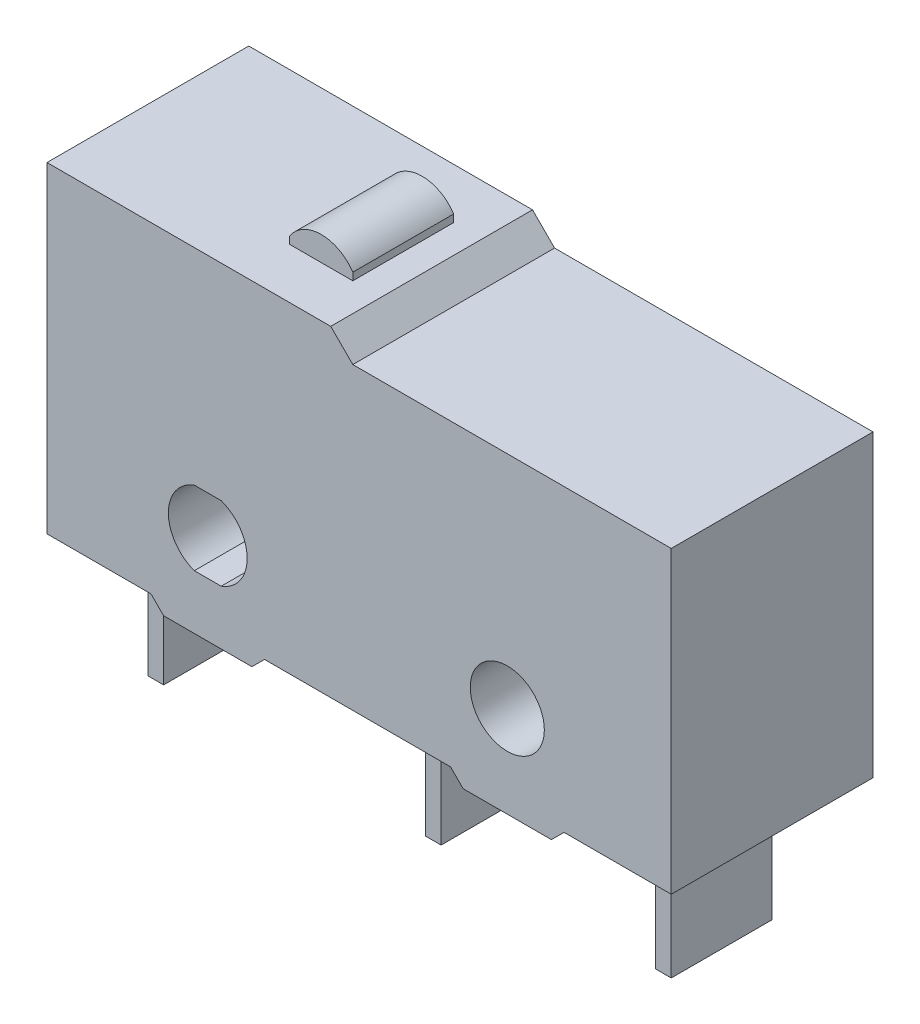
ISO-10303-21;
HEADER;
FILE_DESCRIPTION(('STEP AP214'),'2;1');
FILE_NAME('part.step','',(''),(''),'','','');
FILE_SCHEMA(('AUTOMOTIVE_DESIGN { 1 0 10303 214 1 1 1 1 }'));
ENDSEC;
DATA;
#1=APPLICATION_CONTEXT('core data for automotive mechanical design processes');
#2=APPLICATION_PROTOCOL_DEFINITION('international standard','automotive_design',2000,#1);
#3=PRODUCT_CONTEXT('',#1,'mechanical');
#4=PRODUCT('Part','Part','',(#3));
#5=PRODUCT_RELATED_PRODUCT_CATEGORY('part','',(#4));
#6=PRODUCT_DEFINITION_FORMATION('','',#4);
#7=PRODUCT_DEFINITION_CONTEXT('part definition',#1,'design');
#8=PRODUCT_DEFINITION('design','',#6,#7);
#9=PRODUCT_DEFINITION_SHAPE('','',#8);
#10=(LENGTH_UNIT() NAMED_UNIT(*) SI_UNIT(.MILLI.,.METRE.));
#11=(NAMED_UNIT(*) PLANE_ANGLE_UNIT() SI_UNIT($,.RADIAN.));
#12=(NAMED_UNIT(*) SI_UNIT($,.STERADIAN.) SOLID_ANGLE_UNIT());
#13=UNCERTAINTY_MEASURE_WITH_UNIT(LENGTH_MEASURE(1.E-05),#10,'distance_accuracy_value','');
#14=(GEOMETRIC_REPRESENTATION_CONTEXT(3) GLOBAL_UNCERTAINTY_ASSIGNED_CONTEXT((#13)) GLOBAL_UNIT_ASSIGNED_CONTEXT((#10,
#11,#12)) REPRESENTATION_CONTEXT('',''));
#15=CARTESIAN_POINT('',(0.,0.,0.));
#16=DIRECTION('',(0.,0.,1.));
#17=DIRECTION('',(1.,0.,0.));
#18=AXIS2_PLACEMENT_3D('',#15,#16,#17);
#19=CARTESIAN_POINT('',(-11.3,-2.5,3.2));
#20=DIRECTION('',(0.,1.,0.));
#21=DIRECTION('',(-1.,0.,0.));
#22=AXIS2_PLACEMENT_3D('',#19,#20,#21);
#23=PLANE('',#22);
#24=DIRECTION('',(1.,0.,0.));
#25=VECTOR('',#24,1.);
#26=CARTESIAN_POINT('',(-11.3,-2.5,-3.2));
#27=LINE('',#26,#25);
#28=CARTESIAN_POINT('',(-14.6,-2.5,-3.2));
#29=VERTEX_POINT('',#28);
#30=CARTESIAN_POINT('',(-11.3,-2.5,-3.2));
#31=VERTEX_POINT('',#30);
#32=EDGE_CURVE('E416',#29,#31,#27,.T.);
#33=ORIENTED_EDGE('',*,*,#32,.T.);
#34=DIRECTION('',(0.,0.,-1.));
#35=VECTOR('',#34,1.);
#36=CARTESIAN_POINT('',(-11.3,-2.5,3.2));
#37=LINE('',#36,#35);
#38=CARTESIAN_POINT('',(-11.3,-2.5,3.2));
#39=VERTEX_POINT('',#38);
#40=EDGE_CURVE('E482',#39,#31,#37,.T.);
#41=ORIENTED_EDGE('',*,*,#40,.F.);
#42=DIRECTION('',(1.,0.,0.));
#43=VECTOR('',#42,1.);
#44=CARTESIAN_POINT('',(-11.3,-2.5,3.2));
#45=LINE('',#44,#43);
#46=CARTESIAN_POINT('',(-14.6,-2.5,3.2));
#47=VERTEX_POINT('',#46);
#48=EDGE_CURVE('E445',#47,#39,#45,.T.);
#49=ORIENTED_EDGE('',*,*,#48,.F.);
#50=DIRECTION('',(0.,0.,-1.));
#51=VECTOR('',#50,1.);
#52=CARTESIAN_POINT('',(-14.6,-2.5,3.2));
#53=LINE('',#52,#51);
#54=EDGE_CURVE('E485',#47,#29,#53,.T.);
#55=ORIENTED_EDGE('',*,*,#54,.T.);
#56=EDGE_LOOP('',(#33,#41,#49,#55));
#57=FACE_BOUND('',#56,.T.);
#58=DIRECTION('',(0.,0.,-1.));
#59=VECTOR('',#58,1.);
#60=CARTESIAN_POINT('',(-13.,-2.5,1.6));
#61=LINE('',#60,#59);
#62=CARTESIAN_POINT('',(-13.,-2.5,1.6));
#63=VERTEX_POINT('',#62);
#64=CARTESIAN_POINT('',(-13.,-2.5,-1.6));
#65=VERTEX_POINT('',#64);
#66=EDGE_CURVE('E266',#63,#65,#61,.T.);
#67=ORIENTED_EDGE('',*,*,#66,.F.);
#68=DIRECTION('',(-1.,0.,0.));
#69=VECTOR('',#68,1.);
#70=CARTESIAN_POINT('',(-13.,-2.5,1.6));
#71=LINE('',#70,#69);
#72=CARTESIAN_POINT('',(-12.5,-2.5,1.6));
#73=VERTEX_POINT('',#72);
#74=EDGE_CURVE('E244',#73,#63,#71,.T.);
#75=ORIENTED_EDGE('',*,*,#74,.F.);
#76=DIRECTION('',(0.,0.,1.));
#77=VECTOR('',#76,1.);
#78=CARTESIAN_POINT('',(-12.5,-2.5,1.6));
#79=LINE('',#78,#77);
#80=CARTESIAN_POINT('',(-12.5,-2.5,-1.6));
#81=VERTEX_POINT('',#80);
#82=EDGE_CURVE('E37',#81,#73,#79,.T.);
#83=ORIENTED_EDGE('',*,*,#82,.F.);
#84=DIRECTION('',(1.,0.,0.));
#85=VECTOR('',#84,1.);
#86=CARTESIAN_POINT('',(-13.,-2.5,-1.6));
#87=LINE('',#86,#85);
#88=EDGE_CURVE('E32',#65,#81,#87,.T.);
#89=ORIENTED_EDGE('',*,*,#88,.F.);
#90=EDGE_LOOP('',(#67,#75,#83,#89));
#91=FACE_BOUND('',#90,.T.);
#92=ADVANCED_FACE('F17',(#57,#91),#23,.F.);
#93=CARTESIAN_POINT('',(5.2,-2.5,3.2));
#94=DIRECTION('',(0.,1.,0.));
#95=DIRECTION('',(-1.,0.,0.));
#96=AXIS2_PLACEMENT_3D('',#93,#94,#95);
#97=PLANE('',#96);
#98=DIRECTION('',(1.,0.,0.));
#99=VECTOR('',#98,1.);
#100=CARTESIAN_POINT('',(5.2,-2.5,-3.2));
#101=LINE('',#100,#99);
#102=CARTESIAN_POINT('',(1.8,-2.5,-3.2));
#103=VERTEX_POINT('',#102);
#104=CARTESIAN_POINT('',(5.2,-2.5,-3.2));
#105=VERTEX_POINT('',#104);
#106=EDGE_CURVE('E403',#103,#105,#101,.T.);
#107=ORIENTED_EDGE('',*,*,#106,.T.);
#108=DIRECTION('',(0.,0.,-1.));
#109=VECTOR('',#108,1.);
#110=CARTESIAN_POINT('',(5.2,-2.5,3.2));
#111=LINE('',#110,#109);
#112=CARTESIAN_POINT('',(5.2,-2.5,3.2));
#113=VERTEX_POINT('',#112);
#114=EDGE_CURVE('E25',#113,#105,#111,.T.);
#115=ORIENTED_EDGE('',*,*,#114,.F.);
#116=DIRECTION('',(1.,0.,0.));
#117=VECTOR('',#116,1.);
#118=CARTESIAN_POINT('',(5.2,-2.5,3.2));
#119=LINE('',#118,#117);
#120=CARTESIAN_POINT('',(1.8,-2.5,3.2));
#121=VERTEX_POINT('',#120);
#122=EDGE_CURVE('E432',#121,#113,#119,.T.);
#123=ORIENTED_EDGE('',*,*,#122,.F.);
#124=DIRECTION('',(0.,0.,-1.));
#125=VECTOR('',#124,1.);
#126=CARTESIAN_POINT('',(1.8,-2.5,3.2));
#127=LINE('',#126,#125);
#128=EDGE_CURVE('E461',#121,#103,#127,.T.);
#129=ORIENTED_EDGE('',*,*,#128,.T.);
#130=EDGE_LOOP('',(#107,#115,#123,#129));
#131=FACE_BOUND('',#130,.T.);
#132=DIRECTION('',(0.,0.,-1.));
#133=VECTOR('',#132,1.);
#134=CARTESIAN_POINT('',(3.1,-2.5,1.6));
#135=LINE('',#134,#133);
#136=CARTESIAN_POINT('',(3.1,-2.5,1.6));
#137=VERTEX_POINT('',#136);
#138=CARTESIAN_POINT('',(3.1,-2.5,-1.6));
#139=VERTEX_POINT('',#138);
#140=EDGE_CURVE('E259',#137,#139,#135,.T.);
#141=ORIENTED_EDGE('',*,*,#140,.F.);
#142=DIRECTION('',(-1.,0.,0.));
#143=VECTOR('',#142,1.);
#144=CARTESIAN_POINT('',(3.1,-2.5,1.6));
#145=LINE('',#144,#143);
#146=CARTESIAN_POINT('',(3.6,-2.5,1.6));
#147=VERTEX_POINT('',#146);
#148=EDGE_CURVE('E280',#147,#137,#145,.T.);
#149=ORIENTED_EDGE('',*,*,#148,.F.);
#150=DIRECTION('',(0.,0.,1.));
#151=VECTOR('',#150,1.);
#152=CARTESIAN_POINT('',(3.6,-2.5,1.6));
#153=LINE('',#152,#151);
#154=CARTESIAN_POINT('',(3.6,-2.5,-1.6));
#155=VERTEX_POINT('',#154);
#156=EDGE_CURVE('E277',#155,#147,#153,.T.);
#157=ORIENTED_EDGE('',*,*,#156,.F.);
#158=DIRECTION('',(1.,0.,0.));
#159=VECTOR('',#158,1.);
#160=CARTESIAN_POINT('',(3.1,-2.5,-1.6));
#161=LINE('',#160,#159);
#162=EDGE_CURVE('E262',#139,#155,#161,.T.);
#163=ORIENTED_EDGE('',*,*,#162,.F.);
#164=EDGE_LOOP('',(#141,#149,#157,#163));
#165=FACE_BOUND('',#164,.T.);
#166=ADVANCED_FACE('F19',(#131,#165),#97,.F.);
#167=CARTESIAN_POINT('',(-1.8,-2.5,3.2));
#168=DIRECTION('',(0.,1.,0.));
#169=DIRECTION('',(-1.,0.,0.));
#170=AXIS2_PLACEMENT_3D('',#167,#168,#169);
#171=PLANE('',#170);
#172=DIRECTION('',(1.,0.,0.));
#173=VECTOR('',#172,1.);
#174=CARTESIAN_POINT('',(-1.8,-2.5,-3.2));
#175=LINE('',#174,#173);
#176=CARTESIAN_POINT('',(-7.7,-2.5,-3.2));
#177=VERTEX_POINT('',#176);
#178=CARTESIAN_POINT('',(-1.8,-2.5,-3.2));
#179=VERTEX_POINT('',#178);
#180=EDGE_CURVE('E424',#177,#179,#175,.T.);
#181=ORIENTED_EDGE('',*,*,#180,.T.);
#182=DIRECTION('',(0.,0.,-1.));
#183=VECTOR('',#182,1.);
#184=CARTESIAN_POINT('',(-1.8,-2.5,3.2));
#185=LINE('',#184,#183);
#186=CARTESIAN_POINT('',(-1.8,-2.5,3.2));
#187=VERTEX_POINT('',#186);
#188=EDGE_CURVE('E470',#187,#179,#185,.T.);
#189=ORIENTED_EDGE('',*,*,#188,.F.);
#190=DIRECTION('',(1.,0.,0.));
#191=VECTOR('',#190,1.);
#192=CARTESIAN_POINT('',(-1.8,-2.5,3.2));
#193=LINE('',#192,#191);
#194=CARTESIAN_POINT('',(-7.7,-2.5,3.2));
#195=VERTEX_POINT('',#194);
#196=EDGE_CURVE('E453',#195,#187,#193,.T.);
#197=ORIENTED_EDGE('',*,*,#196,.F.);
#198=DIRECTION('',(0.,0.,-1.));
#199=VECTOR('',#198,1.);
#200=CARTESIAN_POINT('',(-7.7,-2.5,3.2));
#201=LINE('',#200,#199);
#202=EDGE_CURVE('E473',#195,#177,#201,.T.);
#203=ORIENTED_EDGE('',*,*,#202,.T.);
#204=EDGE_LOOP('',(#181,#189,#197,#203));
#205=FACE_BOUND('',#204,.T.);
#206=DIRECTION('',(0.,0.,-1.));
#207=VECTOR('',#206,1.);
#208=CARTESIAN_POINT('',(-4.2,-2.5,1.6));
#209=LINE('',#208,#207);
#210=CARTESIAN_POINT('',(-4.2,-2.5,1.6));
#211=VERTEX_POINT('',#210);
#212=CARTESIAN_POINT('',(-4.2,-2.5,-1.6));
#213=VERTEX_POINT('',#212);
#214=EDGE_CURVE('E304',#211,#213,#209,.T.);
#215=ORIENTED_EDGE('',*,*,#214,.F.);
#216=DIRECTION('',(-1.,0.,0.));
#217=VECTOR('',#216,1.);
#218=CARTESIAN_POINT('',(-4.2,-2.5,1.6));
#219=LINE('',#218,#217);
#220=CARTESIAN_POINT('',(-3.7,-2.5,1.6));
#221=VERTEX_POINT('',#220);
#222=EDGE_CURVE('E313',#221,#211,#219,.T.);
#223=ORIENTED_EDGE('',*,*,#222,.F.);
#224=DIRECTION('',(0.,0.,1.));
#225=VECTOR('',#224,1.);
#226=CARTESIAN_POINT('',(-3.7,-2.5,1.6));
#227=LINE('',#226,#225);
#228=CARTESIAN_POINT('',(-3.7,-2.5,-1.6));
#229=VERTEX_POINT('',#228);
#230=EDGE_CURVE('E310',#229,#221,#227,.T.);
#231=ORIENTED_EDGE('',*,*,#230,.F.);
#232=DIRECTION('',(1.,0.,0.));
#233=VECTOR('',#232,1.);
#234=CARTESIAN_POINT('',(-4.2,-2.5,-1.6));
#235=LINE('',#234,#233);
#236=EDGE_CURVE('E307',#213,#229,#235,.T.);
#237=ORIENTED_EDGE('',*,*,#236,.F.);
#238=EDGE_LOOP('',(#215,#223,#231,#237));
#239=FACE_BOUND('',#238,.T.);
#240=ADVANCED_FACE('F545',(#205,#239),#171,.F.);
#241=CARTESIAN_POINT('',(-6.5,10.7,1.6));
#242=DIRECTION('',(-1.,0.,0.));
#243=DIRECTION('',(0.,-1.,0.));
#244=AXIS2_PLACEMENT_3D('',#241,#242,#243);
#245=PLANE('',#244);
#246=DIRECTION('',(0.,0.,-1.));
#247=VECTOR('',#246,1.);
#248=CARTESIAN_POINT('',(-6.5,7.9361781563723,38.6735015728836));
#249=LINE('',#248,#247);
#250=CARTESIAN_POINT('',(-6.5,7.9361781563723,1.6));
#251=VERTEX_POINT('',#250);
#252=CARTESIAN_POINT('',(-6.5,7.9361781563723,-1.6));
#253=VERTEX_POINT('',#252);
#254=EDGE_CURVE('E338',#251,#253,#249,.T.);
#255=ORIENTED_EDGE('',*,*,#254,.F.);
#256=DIRECTION('',(0.,-1.,0.));
#257=VECTOR('',#256,1.);
#258=CARTESIAN_POINT('',(-6.5,10.7,1.6));
#259=LINE('',#258,#257);
#260=CARTESIAN_POINT('',(-6.5,7.7,1.6));
#261=VERTEX_POINT('',#260);
#262=EDGE_CURVE('E357',#251,#261,#259,.T.);
#263=ORIENTED_EDGE('',*,*,#262,.T.);
#264=DIRECTION('',(0.,0.,-1.));
#265=VECTOR('',#264,1.);
#266=CARTESIAN_POINT('',(-6.5,7.7,1.6));
#267=LINE('',#266,#265);
#268=CARTESIAN_POINT('',(-6.5,7.7,-1.6));
#269=VERTEX_POINT('',#268);
#270=EDGE_CURVE('E345',#261,#269,#267,.T.);
#271=ORIENTED_EDGE('',*,*,#270,.T.);
#272=DIRECTION('',(0.,-1.,0.));
#273=VECTOR('',#272,1.);
#274=CARTESIAN_POINT('',(-6.5,10.7,-1.6));
#275=LINE('',#274,#273);
#276=EDGE_CURVE('E363',#253,#269,#275,.T.);
#277=ORIENTED_EDGE('',*,*,#276,.F.);
#278=EDGE_LOOP('',(#255,#263,#271,#277));
#279=FACE_BOUND('',#278,.T.);
#280=ADVANCED_FACE('F593',(#279),#245,.F.);
#281=CARTESIAN_POINT('',(-6.5,10.7,-1.6));
#282=DIRECTION('',(0.,0.,1.));
#283=DIRECTION('',(1.,0.,0.));
#284=AXIS2_PLACEMENT_3D('',#281,#282,#283);
#285=PLANE('',#284);
#286=CARTESIAN_POINT('',(-7.5,7.27285319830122,-1.6));
#287=DIRECTION('',(0.,0.,1.));
#288=DIRECTION('',(1.,0.,0.));
#289=AXIS2_PLACEMENT_3D('',#286,#287,#288);
#290=CIRCLE('',#289,1.2);
#291=CARTESIAN_POINT('',(-8.5,7.93617815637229,-1.6));
#292=VERTEX_POINT('',#291);
#293=EDGE_CURVE('E341',#253,#292,#290,.T.);
#294=ORIENTED_EDGE('',*,*,#293,.F.);
#295=ORIENTED_EDGE('',*,*,#276,.T.);
#296=DIRECTION('',(-1.,0.,0.));
#297=VECTOR('',#296,1.);
#298=CARTESIAN_POINT('',(-6.5,7.7,-1.6));
#299=LINE('',#298,#297);
#300=CARTESIAN_POINT('',(-8.5,7.7,-1.6));
#301=VERTEX_POINT('',#300);
#302=EDGE_CURVE('E348',#269,#301,#299,.T.);
#303=ORIENTED_EDGE('',*,*,#302,.T.);
#304=DIRECTION('',(0.,-1.,0.));
#305=VECTOR('',#304,1.);
#306=CARTESIAN_POINT('',(-8.5,10.7,-1.6));
#307=LINE('',#306,#305);
#308=EDGE_CURVE('E361',#292,#301,#307,.T.);
#309=ORIENTED_EDGE('',*,*,#308,.F.);
#310=EDGE_LOOP('',(#294,#295,#303,#309));
#311=FACE_BOUND('',#310,.T.);
#312=ADVANCED_FACE('F592',(#311),#285,.F.);
#313=CARTESIAN_POINT('',(-8.5,10.7,1.6));
#314=DIRECTION('',(1.,0.,0.));
#315=DIRECTION('',(0.,1.,0.));
#316=AXIS2_PLACEMENT_3D('',#313,#314,#315);
#317=PLANE('',#316);
#318=DIRECTION('',(0.,0.,-1.));
#319=VECTOR('',#318,1.);
#320=CARTESIAN_POINT('',(-8.5,7.9361781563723,38.6735015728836));
#321=LINE('',#320,#319);
#322=CARTESIAN_POINT('',(-8.5,7.93617815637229,1.6));
#323=VERTEX_POINT('',#322);
#324=EDGE_CURVE('E337',#323,#292,#321,.T.);
#325=ORIENTED_EDGE('',*,*,#324,.T.);
#326=ORIENTED_EDGE('',*,*,#308,.T.);
#327=DIRECTION('',(0.,0.,1.));
#328=VECTOR('',#327,1.);
#329=CARTESIAN_POINT('',(-8.5,7.7,1.6));
#330=LINE('',#329,#328);
#331=CARTESIAN_POINT('',(-8.5,7.7,1.6));
#332=VERTEX_POINT('',#331);
#333=EDGE_CURVE('E351',#301,#332,#330,.T.);
#334=ORIENTED_EDGE('',*,*,#333,.T.);
#335=DIRECTION('',(0.,-1.,0.));
#336=VECTOR('',#335,1.);
#337=CARTESIAN_POINT('',(-8.5,10.7,1.6));
#338=LINE('',#337,#336);
#339=EDGE_CURVE('E359',#323,#332,#338,.T.);
#340=ORIENTED_EDGE('',*,*,#339,.F.);
#341=EDGE_LOOP('',(#325,#326,#334,#340));
#342=FACE_BOUND('',#341,.T.);
#343=ADVANCED_FACE('F587',(#342),#317,.F.);
#344=CARTESIAN_POINT('',(-6.5,10.7,1.6));
#345=DIRECTION('',(0.,0.,-1.));
#346=DIRECTION('',(-1.,0.,0.));
#347=AXIS2_PLACEMENT_3D('',#344,#345,#346);
#348=PLANE('',#347);
#349=CARTESIAN_POINT('',(-7.5,7.27285319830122,1.6));
#350=DIRECTION('',(0.,0.,-1.));
#351=DIRECTION('',(-1.,0.,0.));
#352=AXIS2_PLACEMENT_3D('',#349,#350,#351);
#353=CIRCLE('',#352,1.2);
#354=EDGE_CURVE('E11',#323,#251,#353,.T.);
#355=ORIENTED_EDGE('',*,*,#354,.F.);
#356=ORIENTED_EDGE('',*,*,#339,.T.);
#357=DIRECTION('',(1.,0.,0.));
#358=VECTOR('',#357,1.);
#359=CARTESIAN_POINT('',(-6.5,7.7,1.6));
#360=LINE('',#359,#358);
#361=EDGE_CURVE('E354',#332,#261,#360,.T.);
#362=ORIENTED_EDGE('',*,*,#361,.T.);
#363=ORIENTED_EDGE('',*,*,#262,.F.);
#364=EDGE_LOOP('',(#355,#356,#362,#363));
#365=FACE_BOUND('',#364,.T.);
#366=ADVANCED_FACE('F574',(#365),#348,.F.);
#367=CARTESIAN_POINT('',(-14.6,7.7,3.2));
#368=DIRECTION('',(0.,-1.,0.));
#369=DIRECTION('',(1.,0.,0.));
#370=AXIS2_PLACEMENT_3D('',#367,#368,#369);
#371=PLANE('',#370);
#372=DIRECTION('',(-1.,0.,0.));
#373=VECTOR('',#372,1.);
#374=CARTESIAN_POINT('',(-14.6,7.7,-3.2));
#375=LINE('',#374,#373);
#376=CARTESIAN_POINT('',(-5.6,7.7,-3.2));
#377=VERTEX_POINT('',#376);
#378=CARTESIAN_POINT('',(-14.6,7.7,-3.2));
#379=VERTEX_POINT('',#378);
#380=EDGE_CURVE('E412',#377,#379,#375,.T.);
#381=ORIENTED_EDGE('',*,*,#380,.T.);
#382=DIRECTION('',(0.,0.,-1.));
#383=VECTOR('',#382,1.);
#384=CARTESIAN_POINT('',(-14.6,7.7,3.2));
#385=LINE('',#384,#383);
#386=CARTESIAN_POINT('',(-14.6,7.7,3.2));
#387=VERTEX_POINT('',#386);
#388=EDGE_CURVE('E488',#387,#379,#385,.T.);
#389=ORIENTED_EDGE('',*,*,#388,.F.);
#390=DIRECTION('',(-1.,0.,0.));
#391=VECTOR('',#390,1.);
#392=CARTESIAN_POINT('',(-14.6,7.7,3.2));
#393=LINE('',#392,#391);
#394=CARTESIAN_POINT('',(-5.6,7.7,3.2));
#395=VERTEX_POINT('',#394);
#396=EDGE_CURVE('E441',#395,#387,#393,.T.);
#397=ORIENTED_EDGE('',*,*,#396,.F.);
#398=DIRECTION('',(0.,0.,-1.));
#399=VECTOR('',#398,1.);
#400=CARTESIAN_POINT('',(-5.6,7.7,3.2));
#401=LINE('',#400,#399);
#402=EDGE_CURVE('E491',#395,#377,#401,.T.);
#403=ORIENTED_EDGE('',*,*,#402,.T.);
#404=EDGE_LOOP('',(#381,#389,#397,#403));
#405=FACE_BOUND('',#404,.T.);
#406=ORIENTED_EDGE('',*,*,#270,.F.);
#407=ORIENTED_EDGE('',*,*,#361,.F.);
#408=ORIENTED_EDGE('',*,*,#333,.F.);
#409=ORIENTED_EDGE('',*,*,#302,.F.);
#410=EDGE_LOOP('',(#406,#407,#408,#409));
#411=FACE_BOUND('',#410,.T.);
#412=ADVANCED_FACE('F571',(#405,#411),#371,.F.);
#413=CARTESIAN_POINT('',(5.2,7.,3.2));
#414=DIRECTION('',(-1.,0.,0.));
#415=DIRECTION('',(0.,-1.,0.));
#416=AXIS2_PLACEMENT_3D('',#413,#414,#415);
#417=PLANE('',#416);
#418=DIRECTION('',(0.,1.,0.));
#419=VECTOR('',#418,1.);
#420=CARTESIAN_POINT('',(5.2,7.,-3.2));
#421=LINE('',#420,#419);
#422=CARTESIAN_POINT('',(5.2,7.,-3.2));
#423=VERTEX_POINT('',#422);
#424=EDGE_CURVE('E406',#105,#423,#421,.T.);
#425=ORIENTED_EDGE('',*,*,#424,.T.);
#426=DIRECTION('',(0.,0.,-1.));
#427=VECTOR('',#426,1.);
#428=CARTESIAN_POINT('',(5.2,7.,3.2));
#429=LINE('',#428,#427);
#430=CARTESIAN_POINT('',(5.2,7.,3.2));
#431=VERTEX_POINT('',#430);
#432=EDGE_CURVE('E497',#431,#423,#429,.T.);
#433=ORIENTED_EDGE('',*,*,#432,.F.);
#434=DIRECTION('',(0.,1.,0.));
#435=VECTOR('',#434,1.);
#436=CARTESIAN_POINT('',(5.2,7.,3.2));
#437=LINE('',#436,#435);
#438=EDGE_CURVE('E435',#113,#431,#437,.T.);
#439=ORIENTED_EDGE('',*,*,#438,.F.);
#440=ORIENTED_EDGE('',*,*,#114,.T.);
#441=EDGE_LOOP('',(#425,#433,#439,#440));
#442=FACE_BOUND('',#441,.T.);
#443=ADVANCED_FACE('F502',(#442),#417,.F.);
#444=CARTESIAN_POINT('',(-4.9,7.,3.2));
#445=DIRECTION('',(0.,-1.,0.));
#446=DIRECTION('',(1.,0.,0.));
#447=AXIS2_PLACEMENT_3D('',#444,#445,#446);
#448=PLANE('',#447);
#449=DIRECTION('',(-1.,0.,0.));
#450=VECTOR('',#449,1.);
#451=CARTESIAN_POINT('',(-4.9,7.,-3.2));
#452=LINE('',#451,#450);
#453=CARTESIAN_POINT('',(-4.9,7.,-3.2));
#454=VERTEX_POINT('',#453);
#455=EDGE_CURVE('E408',#423,#454,#452,.T.);
#456=ORIENTED_EDGE('',*,*,#455,.T.);
#457=DIRECTION('',(0.,0.,-1.));
#458=VECTOR('',#457,1.);
#459=CARTESIAN_POINT('',(-4.9,7.,3.2));
#460=LINE('',#459,#458);
#461=CARTESIAN_POINT('',(-4.9,7.,3.2));
#462=VERTEX_POINT('',#461);
#463=EDGE_CURVE('E494',#462,#454,#460,.T.);
#464=ORIENTED_EDGE('',*,*,#463,.F.);
#465=DIRECTION('',(-1.,0.,0.));
#466=VECTOR('',#465,1.);
#467=CARTESIAN_POINT('',(-4.9,7.,3.2));
#468=LINE('',#467,#466);
#469=EDGE_CURVE('E437',#431,#462,#468,.T.);
#470=ORIENTED_EDGE('',*,*,#469,.F.);
#471=ORIENTED_EDGE('',*,*,#432,.T.);
#472=EDGE_LOOP('',(#456,#464,#470,#471));
#473=FACE_BOUND('',#472,.T.);
#474=ADVANCED_FACE('F518',(#473),#448,.F.);
#475=CARTESIAN_POINT('',(-5.6,7.7,3.2));
#476=DIRECTION('',(-0.707106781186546,-0.707106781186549,0.));
#477=DIRECTION('',(0.707106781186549,-0.707106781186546,0.));
#478=AXIS2_PLACEMENT_3D('',#475,#476,#477);
#479=PLANE('',#478);
#480=DIRECTION('',(-0.707106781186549,0.707106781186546,0.));
#481=VECTOR('',#480,1.);
#482=CARTESIAN_POINT('',(-5.6,7.7,-3.2));
#483=LINE('',#482,#481);
#484=EDGE_CURVE('E410',#454,#377,#483,.T.);
#485=ORIENTED_EDGE('',*,*,#484,.T.);
#486=ORIENTED_EDGE('',*,*,#402,.F.);
#487=DIRECTION('',(-0.707106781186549,0.707106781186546,0.));
#488=VECTOR('',#487,1.);
#489=CARTESIAN_POINT('',(-5.6,7.7,3.2));
#490=LINE('',#489,#488);
#491=EDGE_CURVE('E439',#462,#395,#490,.T.);
#492=ORIENTED_EDGE('',*,*,#491,.F.);
#493=ORIENTED_EDGE('',*,*,#463,.T.);
#494=EDGE_LOOP('',(#485,#486,#492,#493));
#495=FACE_BOUND('',#494,.T.);
#496=ADVANCED_FACE('F522',(#495),#479,.F.);
#497=CARTESIAN_POINT('',(-14.6,-2.5,3.2));
#498=DIRECTION('',(1.,0.,0.));
#499=DIRECTION('',(0.,1.,0.));
#500=AXIS2_PLACEMENT_3D('',#497,#498,#499);
#501=PLANE('',#500);
#502=DIRECTION('',(0.,-1.,0.));
#503=VECTOR('',#502,1.);
#504=CARTESIAN_POINT('',(-14.6,-2.5,-3.2));
#505=LINE('',#504,#503);
#506=EDGE_CURVE('E414',#379,#29,#505,.T.);
#507=ORIENTED_EDGE('',*,*,#506,.T.);
#508=ORIENTED_EDGE('',*,*,#54,.F.);
#509=DIRECTION('',(0.,-1.,0.));
#510=VECTOR('',#509,1.);
#511=CARTESIAN_POINT('',(-14.6,-2.5,3.2));
#512=LINE('',#511,#510);
#513=EDGE_CURVE('E443',#387,#47,#512,.T.);
#514=ORIENTED_EDGE('',*,*,#513,.F.);
#515=ORIENTED_EDGE('',*,*,#388,.T.);
#516=EDGE_LOOP('',(#507,#508,#514,#515));
#517=FACE_BOUND('',#516,.T.);
#518=ADVANCED_FACE('F568',(#517),#501,.F.);
#519=CARTESIAN_POINT('',(-10.9,-2.9,3.2));
#520=DIRECTION('',(0.707106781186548,0.707106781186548,0.));
#521=DIRECTION('',(-0.707106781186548,0.707106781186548,0.));
#522=AXIS2_PLACEMENT_3D('',#519,#520,#521);
#523=PLANE('',#522);
#524=DIRECTION('',(0.707106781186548,-0.707106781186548,0.));
#525=VECTOR('',#524,1.);
#526=CARTESIAN_POINT('',(-10.9,-2.9,-3.2));
#527=LINE('',#526,#525);
#528=CARTESIAN_POINT('',(-10.9,-2.9,-3.2));
#529=VERTEX_POINT('',#528);
#530=EDGE_CURVE('E418',#31,#529,#527,.T.);
#531=ORIENTED_EDGE('',*,*,#530,.T.);
#532=DIRECTION('',(0.,0.,-1.));
#533=VECTOR('',#532,1.);
#534=CARTESIAN_POINT('',(-10.9,-2.9,3.2));
#535=LINE('',#534,#533);
#536=CARTESIAN_POINT('',(-10.9,-2.9,3.2));
#537=VERTEX_POINT('',#536);
#538=EDGE_CURVE('E479',#537,#529,#535,.T.);
#539=ORIENTED_EDGE('',*,*,#538,.F.);
#540=DIRECTION('',(0.707106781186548,-0.707106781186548,0.));
#541=VECTOR('',#540,1.);
#542=CARTESIAN_POINT('',(-10.9,-2.9,3.2));
#543=LINE('',#542,#541);
#544=EDGE_CURVE('E447',#39,#537,#543,.T.);
#545=ORIENTED_EDGE('',*,*,#544,.F.);
#546=ORIENTED_EDGE('',*,*,#40,.T.);
#547=EDGE_LOOP('',(#531,#539,#545,#546));
#548=FACE_BOUND('',#547,.T.);
#549=ADVANCED_FACE('F561',(#548),#523,.F.);
#550=CARTESIAN_POINT('',(-8.1,-2.9,3.2));
#551=DIRECTION('',(0.,1.,0.));
#552=DIRECTION('',(-1.,0.,0.));
#553=AXIS2_PLACEMENT_3D('',#550,#551,#552);
#554=PLANE('',#553);
#555=DIRECTION('',(1.,0.,0.));
#556=VECTOR('',#555,1.);
#557=CARTESIAN_POINT('',(-8.1,-2.9,-3.2));
#558=LINE('',#557,#556);
#559=CARTESIAN_POINT('',(-8.1,-2.9,-3.2));
#560=VERTEX_POINT('',#559);
#561=EDGE_CURVE('E420',#529,#560,#558,.T.);
#562=ORIENTED_EDGE('',*,*,#561,.T.);
#563=DIRECTION('',(0.,0.,-1.));
#564=VECTOR('',#563,1.);
#565=CARTESIAN_POINT('',(-8.1,-2.9,3.2));
#566=LINE('',#565,#564);
#567=CARTESIAN_POINT('',(-8.1,-2.9,3.2));
#568=VERTEX_POINT('',#567);
#569=EDGE_CURVE('E476',#568,#560,#566,.T.);
#570=ORIENTED_EDGE('',*,*,#569,.F.);
#571=DIRECTION('',(1.,0.,0.));
#572=VECTOR('',#571,1.);
#573=CARTESIAN_POINT('',(-8.1,-2.9,3.2));
#574=LINE('',#573,#572);
#575=EDGE_CURVE('E449',#537,#568,#574,.T.);
#576=ORIENTED_EDGE('',*,*,#575,.F.);
#577=ORIENTED_EDGE('',*,*,#538,.T.);
#578=EDGE_LOOP('',(#562,#570,#576,#577));
#579=FACE_BOUND('',#578,.T.);
#580=ADVANCED_FACE('F556',(#579),#554,.F.);
#581=CARTESIAN_POINT('',(-7.7,-2.5,3.2));
#582=DIRECTION('',(-0.707106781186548,0.707106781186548,0.));
#583=DIRECTION('',(-0.707106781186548,-0.707106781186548,0.));
#584=AXIS2_PLACEMENT_3D('',#581,#582,#583);
#585=PLANE('',#584);
#586=DIRECTION('',(0.707106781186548,0.707106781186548,0.));
#587=VECTOR('',#586,1.);
#588=CARTESIAN_POINT('',(-7.7,-2.5,-3.2));
#589=LINE('',#588,#587);
#590=EDGE_CURVE('E422',#560,#177,#589,.T.);
#591=ORIENTED_EDGE('',*,*,#590,.T.);
#592=ORIENTED_EDGE('',*,*,#202,.F.);
#593=DIRECTION('',(0.707106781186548,0.707106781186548,0.));
#594=VECTOR('',#593,1.);
#595=CARTESIAN_POINT('',(-7.7,-2.5,3.2));
#596=LINE('',#595,#594);
#597=EDGE_CURVE('E451',#568,#195,#596,.T.);
#598=ORIENTED_EDGE('',*,*,#597,.F.);
#599=ORIENTED_EDGE('',*,*,#569,.T.);
#600=EDGE_LOOP('',(#591,#592,#598,#599));
#601=FACE_BOUND('',#600,.T.);
#602=ADVANCED_FACE('F550',(#601),#585,.F.);
#603=CARTESIAN_POINT('',(-1.4,-2.9,3.2));
#604=DIRECTION('',(0.707106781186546,0.70710678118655,0.));
#605=DIRECTION('',(-0.70710678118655,0.707106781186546,0.));
#606=AXIS2_PLACEMENT_3D('',#603,#604,#605);
#607=PLANE('',#606);
#608=DIRECTION('',(0.70710678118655,-0.707106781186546,0.));
#609=VECTOR('',#608,1.);
#610=CARTESIAN_POINT('',(-1.4,-2.9,-3.2));
#611=LINE('',#610,#609);
#612=CARTESIAN_POINT('',(-1.4,-2.9,-3.2));
#613=VERTEX_POINT('',#612);
#614=EDGE_CURVE('E426',#179,#613,#611,.T.);
#615=ORIENTED_EDGE('',*,*,#614,.T.);
#616=DIRECTION('',(0.,0.,-1.));
#617=VECTOR('',#616,1.);
#618=CARTESIAN_POINT('',(-1.4,-2.9,3.2));
#619=LINE('',#618,#617);
#620=CARTESIAN_POINT('',(-1.4,-2.9,3.2));
#621=VERTEX_POINT('',#620);
#622=EDGE_CURVE('E467',#621,#613,#619,.T.);
#623=ORIENTED_EDGE('',*,*,#622,.F.);
#624=DIRECTION('',(0.70710678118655,-0.707106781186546,0.));
#625=VECTOR('',#624,1.);
#626=CARTESIAN_POINT('',(-1.4,-2.9,3.2));
#627=LINE('',#626,#625);
#628=EDGE_CURVE('E455',#187,#621,#627,.T.);
#629=ORIENTED_EDGE('',*,*,#628,.F.);
#630=ORIENTED_EDGE('',*,*,#188,.T.);
#631=EDGE_LOOP('',(#615,#623,#629,#630));
#632=FACE_BOUND('',#631,.T.);
#633=ADVANCED_FACE('F540',(#632),#607,.F.);
#634=CARTESIAN_POINT('',(1.4,-2.9,3.2));
#635=DIRECTION('',(0.,1.,0.));
#636=DIRECTION('',(-1.,0.,0.));
#637=AXIS2_PLACEMENT_3D('',#634,#635,#636);
#638=PLANE('',#637);
#639=DIRECTION('',(1.,0.,0.));
#640=VECTOR('',#639,1.);
#641=CARTESIAN_POINT('',(1.4,-2.9,-3.2));
#642=LINE('',#641,#640);
#643=CARTESIAN_POINT('',(1.4,-2.9,-3.2));
#644=VERTEX_POINT('',#643);
#645=EDGE_CURVE('E428',#613,#644,#642,.T.);
#646=ORIENTED_EDGE('',*,*,#645,.T.);
#647=DIRECTION('',(0.,0.,-1.));
#648=VECTOR('',#647,1.);
#649=CARTESIAN_POINT('',(1.4,-2.9,3.2));
#650=LINE('',#649,#648);
#651=CARTESIAN_POINT('',(1.4,-2.9,3.2));
#652=VERTEX_POINT('',#651);
#653=EDGE_CURVE('E464',#652,#644,#650,.T.);
#654=ORIENTED_EDGE('',*,*,#653,.F.);
#655=DIRECTION('',(1.,0.,0.));
#656=VECTOR('',#655,1.);
#657=CARTESIAN_POINT('',(1.4,-2.9,3.2));
#658=LINE('',#657,#656);
#659=EDGE_CURVE('E457',#621,#652,#658,.T.);
#660=ORIENTED_EDGE('',*,*,#659,.F.);
#661=ORIENTED_EDGE('',*,*,#622,.T.);
#662=EDGE_LOOP('',(#646,#654,#660,#661));
#663=FACE_BOUND('',#662,.T.);
#664=ADVANCED_FACE('F534',(#663),#638,.F.);
#665=CARTESIAN_POINT('',(1.8,-2.5,3.2));
#666=DIRECTION('',(-0.707106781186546,0.70710678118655,0.));
#667=DIRECTION('',(-0.70710678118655,-0.707106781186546,0.));
#668=AXIS2_PLACEMENT_3D('',#665,#666,#667);
#669=PLANE('',#668);
#670=DIRECTION('',(0.70710678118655,0.707106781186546,0.));
#671=VECTOR('',#670,1.);
#672=CARTESIAN_POINT('',(1.8,-2.5,-3.2));
#673=LINE('',#672,#671);
#674=EDGE_CURVE('E430',#644,#103,#673,.T.);
#675=ORIENTED_EDGE('',*,*,#674,.T.);
#676=ORIENTED_EDGE('',*,*,#128,.F.);
#677=DIRECTION('',(0.70710678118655,0.707106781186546,0.));
#678=VECTOR('',#677,1.);
#679=CARTESIAN_POINT('',(1.8,-2.5,3.2));
#680=LINE('',#679,#678);
#681=EDGE_CURVE('E459',#652,#121,#680,.T.);
#682=ORIENTED_EDGE('',*,*,#681,.F.);
#683=ORIENTED_EDGE('',*,*,#653,.T.);
#684=EDGE_LOOP('',(#675,#676,#682,#683));
#685=FACE_BOUND('',#684,.T.);
#686=ADVANCED_FACE('F532',(#685),#669,.F.);
#687=CARTESIAN_POINT('',(5.2,-2.5,3.2));
#688=DIRECTION('',(0.,0.,1.));
#689=DIRECTION('',(1.,0.,0.));
#690=AXIS2_PLACEMENT_3D('',#687,#688,#689);
#691=PLANE('',#690);
#692=CARTESIAN_POINT('',(-9.5,0.,3.2));
#693=DIRECTION('',(0.,0.,1.));
#694=DIRECTION('',(1.,0.,0.));
#695=AXIS2_PLACEMENT_3D('',#692,#693,#694);
#696=CIRCLE('',#695,1.25);
#697=CARTESIAN_POINT('',(-9.92646805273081,1.175,3.2));
#698=VERTEX_POINT('',#697);
#699=CARTESIAN_POINT('',(-9.92646805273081,-1.175,3.2));
#700=VERTEX_POINT('',#699);
#701=EDGE_CURVE('E365',#698,#700,#696,.T.);
#702=ORIENTED_EDGE('',*,*,#701,.F.);
#703=DIRECTION('',(-1.,0.,0.));
#704=VECTOR('',#703,1.);
#705=CARTESIAN_POINT('',(-9.92646805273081,1.175,3.2));
#706=LINE('',#705,#704);
#707=CARTESIAN_POINT('',(-9.07353194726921,1.175,3.2));
#708=VERTEX_POINT('',#707);
#709=EDGE_CURVE('E373',#708,#698,#706,.T.);
#710=ORIENTED_EDGE('',*,*,#709,.F.);
#711=CARTESIAN_POINT('',(-9.5,0.,3.2));
#712=DIRECTION('',(0.,0.,1.));
#713=DIRECTION('',(1.,0.,0.));
#714=AXIS2_PLACEMENT_3D('',#711,#712,#713);
#715=CIRCLE('',#714,1.25);
#716=CARTESIAN_POINT('',(-9.07353194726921,-1.175,3.2));
#717=VERTEX_POINT('',#716);
#718=EDGE_CURVE('E370',#717,#708,#715,.T.);
#719=ORIENTED_EDGE('',*,*,#718,.F.);
#720=DIRECTION('',(1.,0.,0.));
#721=VECTOR('',#720,1.);
#722=CARTESIAN_POINT('',(-9.92646805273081,-1.175,3.2));
#723=LINE('',#722,#721);
#724=EDGE_CURVE('E367',#700,#717,#723,.T.);
#725=ORIENTED_EDGE('',*,*,#724,.F.);
#726=EDGE_LOOP('',(#702,#710,#719,#725));
#727=FACE_BOUND('',#726,.T.);
#728=CARTESIAN_POINT('',(0.,0.,3.2));
#729=DIRECTION('',(0.,0.,1.));
#730=DIRECTION('',(1.,0.,0.));
#731=AXIS2_PLACEMENT_3D('',#728,#729,#730);
#732=CIRCLE('',#731,1.175);
#733=CARTESIAN_POINT('',(1.175,0.,3.2));
#734=VERTEX_POINT('',#733);
#735=EDGE_CURVE('E391',#734,#734,#732,.T.);
#736=ORIENTED_EDGE('',*,*,#735,.F.);
#737=EDGE_LOOP('',(#736));
#738=FACE_BOUND('',#737,.T.);
#739=ORIENTED_EDGE('',*,*,#122,.T.);
#740=ORIENTED_EDGE('',*,*,#438,.T.);
#741=ORIENTED_EDGE('',*,*,#469,.T.);
#742=ORIENTED_EDGE('',*,*,#491,.T.);
#743=ORIENTED_EDGE('',*,*,#396,.T.);
#744=ORIENTED_EDGE('',*,*,#513,.T.);
#745=ORIENTED_EDGE('',*,*,#48,.T.);
#746=ORIENTED_EDGE('',*,*,#544,.T.);
#747=ORIENTED_EDGE('',*,*,#575,.T.);
#748=ORIENTED_EDGE('',*,*,#597,.T.);
#749=ORIENTED_EDGE('',*,*,#196,.T.);
#750=ORIENTED_EDGE('',*,*,#628,.T.);
#751=ORIENTED_EDGE('',*,*,#659,.T.);
#752=ORIENTED_EDGE('',*,*,#681,.T.);
#753=EDGE_LOOP('',(#739,#740,#741,#742,#743,#744,#745,#746,#747,#748,#749,#750,#751,#752));
#754=FACE_BOUND('',#753,.T.);
#755=ADVANCED_FACE('F526',(#727,#738,#754),#691,.T.);
#756=CARTESIAN_POINT('',(5.2,-2.5,-3.2));
#757=DIRECTION('',(0.,0.,1.));
#758=DIRECTION('',(1.,0.,0.));
#759=AXIS2_PLACEMENT_3D('',#756,#757,#758);
#760=PLANE('',#759);
#761=DIRECTION('',(-1.,0.,0.));
#762=VECTOR('',#761,1.);
#763=CARTESIAN_POINT('',(-9.92646805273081,1.175,-3.2));
#764=LINE('',#763,#762);
#765=CARTESIAN_POINT('',(-9.07353194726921,1.175,-3.2));
#766=VERTEX_POINT('',#765);
#767=CARTESIAN_POINT('',(-9.92646805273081,1.175,-3.2));
#768=VERTEX_POINT('',#767);
#769=EDGE_CURVE('E385',#766,#768,#764,.T.);
#770=ORIENTED_EDGE('',*,*,#769,.T.);
#771=CARTESIAN_POINT('',(-9.5,0.,-3.2));
#772=DIRECTION('',(0.,0.,1.));
#773=DIRECTION('',(1.,0.,0.));
#774=AXIS2_PLACEMENT_3D('',#771,#772,#773);
#775=CIRCLE('',#774,1.25);
#776=CARTESIAN_POINT('',(-9.92646805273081,-1.175,-3.2));
#777=VERTEX_POINT('',#776);
#778=EDGE_CURVE('E376',#768,#777,#775,.T.);
#779=ORIENTED_EDGE('',*,*,#778,.T.);
#780=DIRECTION('',(1.,0.,0.));
#781=VECTOR('',#780,1.);
#782=CARTESIAN_POINT('',(-9.92646805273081,-1.175,-3.2));
#783=LINE('',#782,#781);
#784=CARTESIAN_POINT('',(-9.07353194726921,-1.175,-3.2));
#785=VERTEX_POINT('',#784);
#786=EDGE_CURVE('E379',#777,#785,#783,.T.);
#787=ORIENTED_EDGE('',*,*,#786,.T.);
#788=CARTESIAN_POINT('',(-9.5,0.,-3.2));
#789=DIRECTION('',(0.,0.,1.));
#790=DIRECTION('',(1.,0.,0.));
#791=AXIS2_PLACEMENT_3D('',#788,#789,#790);
#792=CIRCLE('',#791,1.25);
#793=EDGE_CURVE('E382',#785,#766,#792,.T.);
#794=ORIENTED_EDGE('',*,*,#793,.T.);
#795=EDGE_LOOP('',(#770,#779,#787,#794));
#796=FACE_BOUND('',#795,.T.);
#797=CARTESIAN_POINT('',(0.,0.,-3.2));
#798=DIRECTION('',(0.,0.,1.));
#799=DIRECTION('',(1.,0.,0.));
#800=AXIS2_PLACEMENT_3D('',#797,#798,#799);
#801=CIRCLE('',#800,1.175);
#802=CARTESIAN_POINT('',(1.175,0.,-3.2));
#803=VERTEX_POINT('',#802);
#804=EDGE_CURVE('E400',#803,#803,#801,.T.);
#805=ORIENTED_EDGE('',*,*,#804,.T.);
#806=EDGE_LOOP('',(#805));
#807=FACE_BOUND('',#806,.T.);
#808=ORIENTED_EDGE('',*,*,#106,.F.);
#809=ORIENTED_EDGE('',*,*,#674,.F.);
#810=ORIENTED_EDGE('',*,*,#645,.F.);
#811=ORIENTED_EDGE('',*,*,#614,.F.);
#812=ORIENTED_EDGE('',*,*,#180,.F.);
#813=ORIENTED_EDGE('',*,*,#590,.F.);
#814=ORIENTED_EDGE('',*,*,#561,.F.);
#815=ORIENTED_EDGE('',*,*,#530,.F.);
#816=ORIENTED_EDGE('',*,*,#32,.F.);
#817=ORIENTED_EDGE('',*,*,#506,.F.);
#818=ORIENTED_EDGE('',*,*,#380,.F.);
#819=ORIENTED_EDGE('',*,*,#484,.F.);
#820=ORIENTED_EDGE('',*,*,#455,.F.);
#821=ORIENTED_EDGE('',*,*,#424,.F.);
#822=EDGE_LOOP('',(#808,#809,#810,#811,#812,#813,#814,#815,#816,#817,#818,#819,#820,#821));
#823=FACE_BOUND('',#822,.T.);
#824=ADVANCED_FACE('F511',(#796,#807,#823),#760,.F.);
#825=CARTESIAN_POINT('',(0.,0.,-3.2));
#826=DIRECTION('',(0.,0.,1.));
#827=DIRECTION('',(1.,0.,0.));
#828=AXIS2_PLACEMENT_3D('',#825,#826,#827);
#829=CYLINDRICAL_SURFACE('',#828,1.175);
#830=ORIENTED_EDGE('',*,*,#804,.F.);
#831=EDGE_LOOP('',(#830));
#832=FACE_BOUND('',#831,.T.);
#833=ORIENTED_EDGE('',*,*,#735,.T.);
#834=EDGE_LOOP('',(#833));
#835=FACE_BOUND('',#834,.T.);
#836=ADVANCED_FACE('F697',(#832,#835),#829,.F.);
#837=CARTESIAN_POINT('',(-9.5,0.,-3.2));
#838=DIRECTION('',(0.,0.,1.));
#839=DIRECTION('',(1.,0.,0.));
#840=AXIS2_PLACEMENT_3D('',#837,#838,#839);
#841=CYLINDRICAL_SURFACE('',#840,1.25);
#842=ORIENTED_EDGE('',*,*,#701,.T.);
#843=DIRECTION('',(0.,0.,1.));
#844=VECTOR('',#843,1.);
#845=CARTESIAN_POINT('',(-9.92646805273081,-1.175,-3.2));
#846=LINE('',#845,#844);
#847=EDGE_CURVE('E388',#777,#700,#846,.T.);
#848=ORIENTED_EDGE('',*,*,#847,.F.);
#849=ORIENTED_EDGE('',*,*,#778,.F.);
#850=DIRECTION('',(0.,0.,1.));
#851=VECTOR('',#850,1.);
#852=CARTESIAN_POINT('',(-9.92646805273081,1.175,-3.2));
#853=LINE('',#852,#851);
#854=EDGE_CURVE('E389',#768,#698,#853,.T.);
#855=ORIENTED_EDGE('',*,*,#854,.T.);
#856=EDGE_LOOP('',(#842,#848,#849,#855));
#857=FACE_BOUND('',#856,.T.);
#858=ADVANCED_FACE('F706',(#857),#841,.F.);
#859=CARTESIAN_POINT('',(-9.92646805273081,1.175,-3.2));
#860=DIRECTION('',(0.,1.,0.));
#861=DIRECTION('',(-1.,0.,0.));
#862=AXIS2_PLACEMENT_3D('',#859,#860,#861);
#863=PLANE('',#862);
#864=ORIENTED_EDGE('',*,*,#709,.T.);
#865=ORIENTED_EDGE('',*,*,#854,.F.);
#866=ORIENTED_EDGE('',*,*,#769,.F.);
#867=DIRECTION('',(0.,0.,1.));
#868=VECTOR('',#867,1.);
#869=CARTESIAN_POINT('',(-9.07353194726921,1.175,-3.2));
#870=LINE('',#869,#868);
#871=EDGE_CURVE('E392',#766,#708,#870,.T.);
#872=ORIENTED_EDGE('',*,*,#871,.T.);
#873=EDGE_LOOP('',(#864,#865,#866,#872));
#874=FACE_BOUND('',#873,.T.);
#875=ADVANCED_FACE('F715',(#874),#863,.F.);
#876=CARTESIAN_POINT('',(-9.5,0.,-3.2));
#877=DIRECTION('',(0.,0.,1.));
#878=DIRECTION('',(1.,0.,0.));
#879=AXIS2_PLACEMENT_3D('',#876,#877,#878);
#880=CYLINDRICAL_SURFACE('',#879,1.25);
#881=ORIENTED_EDGE('',*,*,#718,.T.);
#882=ORIENTED_EDGE('',*,*,#871,.F.);
#883=ORIENTED_EDGE('',*,*,#793,.F.);
#884=DIRECTION('',(0.,0.,1.));
#885=VECTOR('',#884,1.);
#886=CARTESIAN_POINT('',(-9.07353194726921,-1.175,-3.2));
#887=LINE('',#886,#885);
#888=EDGE_CURVE('E394',#785,#717,#887,.T.);
#889=ORIENTED_EDGE('',*,*,#888,.T.);
#890=EDGE_LOOP('',(#881,#882,#883,#889));
#891=FACE_BOUND('',#890,.T.);
#892=ADVANCED_FACE('F724',(#891),#880,.F.);
#893=CARTESIAN_POINT('',(-9.92646805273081,-1.175,-3.2));
#894=DIRECTION('',(0.,-1.,0.));
#895=DIRECTION('',(0.,0.,-1.));
#896=AXIS2_PLACEMENT_3D('',#893,#894,#895);
#897=PLANE('',#896);
#898=ORIENTED_EDGE('',*,*,#724,.T.);
#899=ORIENTED_EDGE('',*,*,#888,.F.);
#900=ORIENTED_EDGE('',*,*,#786,.F.);
#901=ORIENTED_EDGE('',*,*,#847,.T.);
#902=EDGE_LOOP('',(#898,#899,#900,#901));
#903=FACE_BOUND('',#902,.T.);
#904=ADVANCED_FACE('F732',(#903),#897,.F.);
#905=CARTESIAN_POINT('',(-7.5,7.27285319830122,38.6735015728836));
#906=DIRECTION('',(0.,0.,-1.));
#907=DIRECTION('',(-1.,0.,0.));
#908=AXIS2_PLACEMENT_3D('',#905,#906,#907);
#909=CYLINDRICAL_SURFACE('',#908,1.2);
#910=ORIENTED_EDGE('',*,*,#254,.T.);
#911=ORIENTED_EDGE('',*,*,#293,.T.);
#912=ORIENTED_EDGE('',*,*,#324,.F.);
#913=ORIENTED_EDGE('',*,*,#354,.T.);
#914=EDGE_LOOP('',(#910,#911,#912,#913));
#915=FACE_BOUND('',#914,.T.);
#916=ADVANCED_FACE('F590',(#915),#909,.T.);
#917=CARTESIAN_POINT('',(-4.2,-6.4,1.6));
#918=DIRECTION('',(1.,0.,0.));
#919=DIRECTION('',(0.,1.,0.));
#920=AXIS2_PLACEMENT_3D('',#917,#918,#919);
#921=PLANE('',#920);
#922=ORIENTED_EDGE('',*,*,#214,.T.);
#923=DIRECTION('',(0.,1.,0.));
#924=VECTOR('',#923,1.);
#925=CARTESIAN_POINT('',(-4.2,-6.4,-1.6));
#926=LINE('',#925,#924);
#927=CARTESIAN_POINT('',(-4.2,-6.4,-1.6));
#928=VERTEX_POINT('',#927);
#929=EDGE_CURVE('E334',#928,#213,#926,.T.);
#930=ORIENTED_EDGE('',*,*,#929,.F.);
#931=DIRECTION('',(0.,0.,-1.));
#932=VECTOR('',#931,1.);
#933=CARTESIAN_POINT('',(-4.2,-6.4,1.6));
#934=LINE('',#933,#932);
#935=CARTESIAN_POINT('',(-4.2,-6.4,1.6));
#936=VERTEX_POINT('',#935);
#937=EDGE_CURVE('E316',#936,#928,#934,.T.);
#938=ORIENTED_EDGE('',*,*,#937,.F.);
#939=DIRECTION('',(0.,1.,0.));
#940=VECTOR('',#939,1.);
#941=CARTESIAN_POINT('',(-4.2,-6.4,1.6));
#942=LINE('',#941,#940);
#943=EDGE_CURVE('E325',#936,#211,#942,.T.);
#944=ORIENTED_EDGE('',*,*,#943,.T.);
#945=EDGE_LOOP('',(#922,#930,#938,#944));
#946=FACE_BOUND('',#945,.T.);
#947=ADVANCED_FACE('F750',(#946),#921,.F.);
#948=CARTESIAN_POINT('',(-4.2,-6.4,-1.6));
#949=DIRECTION('',(0.,0.,1.));
#950=DIRECTION('',(1.,0.,0.));
#951=AXIS2_PLACEMENT_3D('',#948,#949,#950);
#952=PLANE('',#951);
#953=ORIENTED_EDGE('',*,*,#236,.T.);
#954=DIRECTION('',(0.,1.,0.));
#955=VECTOR('',#954,1.);
#956=CARTESIAN_POINT('',(-3.7,-6.4,-1.6));
#957=LINE('',#956,#955);
#958=CARTESIAN_POINT('',(-3.7,-6.4,-1.6));
#959=VERTEX_POINT('',#958);
#960=EDGE_CURVE('E331',#959,#229,#957,.T.);
#961=ORIENTED_EDGE('',*,*,#960,.F.);
#962=DIRECTION('',(1.,0.,0.));
#963=VECTOR('',#962,1.);
#964=CARTESIAN_POINT('',(-4.2,-6.4,-1.6));
#965=LINE('',#964,#963);
#966=EDGE_CURVE('E319',#928,#959,#965,.T.);
#967=ORIENTED_EDGE('',*,*,#966,.F.);
#968=ORIENTED_EDGE('',*,*,#929,.T.);
#969=EDGE_LOOP('',(#953,#961,#967,#968));
#970=FACE_BOUND('',#969,.T.);
#971=ADVANCED_FACE('F758',(#970),#952,.F.);
#972=CARTESIAN_POINT('',(-3.7,-6.4,1.6));
#973=DIRECTION('',(-1.,0.,0.));
#974=DIRECTION('',(0.,-1.,0.));
#975=AXIS2_PLACEMENT_3D('',#972,#973,#974);
#976=PLANE('',#975);
#977=ORIENTED_EDGE('',*,*,#230,.T.);
#978=DIRECTION('',(0.,1.,0.));
#979=VECTOR('',#978,1.);
#980=CARTESIAN_POINT('',(-3.7,-6.4,1.6));
#981=LINE('',#980,#979);
#982=CARTESIAN_POINT('',(-3.7,-6.4,1.6));
#983=VERTEX_POINT('',#982);
#984=EDGE_CURVE('E328',#983,#221,#981,.T.);
#985=ORIENTED_EDGE('',*,*,#984,.F.);
#986=DIRECTION('',(0.,0.,1.));
#987=VECTOR('',#986,1.);
#988=CARTESIAN_POINT('',(-3.7,-6.4,1.6));
#989=LINE('',#988,#987);
#990=EDGE_CURVE('E321',#959,#983,#989,.T.);
#991=ORIENTED_EDGE('',*,*,#990,.F.);
#992=ORIENTED_EDGE('',*,*,#960,.T.);
#993=EDGE_LOOP('',(#977,#985,#991,#992));
#994=FACE_BOUND('',#993,.T.);
#995=ADVANCED_FACE('F766',(#994),#976,.F.);
#996=CARTESIAN_POINT('',(-4.2,-6.4,1.6));
#997=DIRECTION('',(0.,0.,-1.));
#998=DIRECTION('',(-1.,0.,0.));
#999=AXIS2_PLACEMENT_3D('',#996,#997,#998);
#1000=PLANE('',#999);
#1001=ORIENTED_EDGE('',*,*,#222,.T.);
#1002=ORIENTED_EDGE('',*,*,#943,.F.);
#1003=DIRECTION('',(-1.,0.,0.));
#1004=VECTOR('',#1003,1.);
#1005=CARTESIAN_POINT('',(-4.2,-6.4,1.6));
#1006=LINE('',#1005,#1004);
#1007=EDGE_CURVE('E323',#983,#936,#1006,.T.);
#1008=ORIENTED_EDGE('',*,*,#1007,.F.);
#1009=ORIENTED_EDGE('',*,*,#984,.T.);
#1010=EDGE_LOOP('',(#1001,#1002,#1008,#1009));
#1011=FACE_BOUND('',#1010,.T.);
#1012=ADVANCED_FACE('F774',(#1011),#1000,.F.);
#1013=CARTESIAN_POINT('',(-4.2,-6.4,1.6));
#1014=DIRECTION('',(0.,-1.,0.));
#1015=DIRECTION('',(0.,0.,-1.));
#1016=AXIS2_PLACEMENT_3D('',#1013,#1014,#1015);
#1017=PLANE('',#1016);
#1018=ORIENTED_EDGE('',*,*,#937,.T.);
#1019=ORIENTED_EDGE('',*,*,#966,.T.);
#1020=ORIENTED_EDGE('',*,*,#990,.T.);
#1021=ORIENTED_EDGE('',*,*,#1007,.T.);
#1022=EDGE_LOOP('',(#1018,#1019,#1020,#1021));
#1023=FACE_BOUND('',#1022,.T.);
#1024=ADVANCED_FACE('F782',(#1023),#1017,.T.);
#1025=CARTESIAN_POINT('',(3.1,-6.4,1.6));
#1026=DIRECTION('',(1.,0.,0.));
#1027=DIRECTION('',(0.,0.,-1.));
#1028=AXIS2_PLACEMENT_3D('',#1025,#1026,#1027);
#1029=PLANE('',#1028);
#1030=ORIENTED_EDGE('',*,*,#140,.T.);
#1031=DIRECTION('',(0.,1.,0.));
#1032=VECTOR('',#1031,1.);
#1033=CARTESIAN_POINT('',(3.1,-6.4,-1.6));
#1034=LINE('',#1033,#1032);
#1035=CARTESIAN_POINT('',(3.1,-6.4,-1.6));
#1036=VERTEX_POINT('',#1035);
#1037=EDGE_CURVE('E301',#1036,#139,#1034,.T.);
#1038=ORIENTED_EDGE('',*,*,#1037,.F.);
#1039=DIRECTION('',(0.,0.,-1.));
#1040=VECTOR('',#1039,1.);
#1041=CARTESIAN_POINT('',(3.1,-6.4,1.6));
#1042=LINE('',#1041,#1040);
#1043=CARTESIAN_POINT('',(3.1,-6.4,1.6));
#1044=VERTEX_POINT('',#1043);
#1045=EDGE_CURVE('E283',#1044,#1036,#1042,.T.);
#1046=ORIENTED_EDGE('',*,*,#1045,.F.);
#1047=DIRECTION('',(0.,1.,0.));
#1048=VECTOR('',#1047,1.);
#1049=CARTESIAN_POINT('',(3.1,-6.4,1.6));
#1050=LINE('',#1049,#1048);
#1051=EDGE_CURVE('E292',#1044,#137,#1050,.T.);
#1052=ORIENTED_EDGE('',*,*,#1051,.T.);
#1053=EDGE_LOOP('',(#1030,#1038,#1046,#1052));
#1054=FACE_BOUND('',#1053,.T.);
#1055=ADVANCED_FACE('F790',(#1054),#1029,.F.);
#1056=CARTESIAN_POINT('',(3.1,-6.4,-1.6));
#1057=DIRECTION('',(0.,0.,1.));
#1058=DIRECTION('',(1.,0.,0.));
#1059=AXIS2_PLACEMENT_3D('',#1056,#1057,#1058);
#1060=PLANE('',#1059);
#1061=ORIENTED_EDGE('',*,*,#162,.T.);
#1062=DIRECTION('',(0.,1.,0.));
#1063=VECTOR('',#1062,1.);
#1064=CARTESIAN_POINT('',(3.6,-6.4,-1.6));
#1065=LINE('',#1064,#1063);
#1066=CARTESIAN_POINT('',(3.6,-6.4,-1.6));
#1067=VERTEX_POINT('',#1066);
#1068=EDGE_CURVE('E298',#1067,#155,#1065,.T.);
#1069=ORIENTED_EDGE('',*,*,#1068,.F.);
#1070=DIRECTION('',(1.,0.,0.));
#1071=VECTOR('',#1070,1.);
#1072=CARTESIAN_POINT('',(3.1,-6.4,-1.6));
#1073=LINE('',#1072,#1071);
#1074=EDGE_CURVE('E286',#1036,#1067,#1073,.T.);
#1075=ORIENTED_EDGE('',*,*,#1074,.F.);
#1076=ORIENTED_EDGE('',*,*,#1037,.T.);
#1077=EDGE_LOOP('',(#1061,#1069,#1075,#1076));
#1078=FACE_BOUND('',#1077,.T.);
#1079=ADVANCED_FACE('F798',(#1078),#1060,.F.);
#1080=CARTESIAN_POINT('',(3.6,-6.4,1.6));
#1081=DIRECTION('',(-1.,0.,0.));
#1082=DIRECTION('',(0.,-1.,0.));
#1083=AXIS2_PLACEMENT_3D('',#1080,#1081,#1082);
#1084=PLANE('',#1083);
#1085=ORIENTED_EDGE('',*,*,#156,.T.);
#1086=DIRECTION('',(0.,1.,0.));
#1087=VECTOR('',#1086,1.);
#1088=CARTESIAN_POINT('',(3.6,-6.4,1.6));
#1089=LINE('',#1088,#1087);
#1090=CARTESIAN_POINT('',(3.6,-6.4,1.6));
#1091=VERTEX_POINT('',#1090);
#1092=EDGE_CURVE('E295',#1091,#147,#1089,.T.);
#1093=ORIENTED_EDGE('',*,*,#1092,.F.);
#1094=DIRECTION('',(0.,0.,1.));
#1095=VECTOR('',#1094,1.);
#1096=CARTESIAN_POINT('',(3.6,-6.4,1.6));
#1097=LINE('',#1096,#1095);
#1098=EDGE_CURVE('E288',#1067,#1091,#1097,.T.);
#1099=ORIENTED_EDGE('',*,*,#1098,.F.);
#1100=ORIENTED_EDGE('',*,*,#1068,.T.);
#1101=EDGE_LOOP('',(#1085,#1093,#1099,#1100));
#1102=FACE_BOUND('',#1101,.T.);
#1103=ADVANCED_FACE('F806',(#1102),#1084,.F.);
#1104=CARTESIAN_POINT('',(3.1,-6.4,1.6));
#1105=DIRECTION('',(0.,0.,-1.));
#1106=DIRECTION('',(-1.,0.,0.));
#1107=AXIS2_PLACEMENT_3D('',#1104,#1105,#1106);
#1108=PLANE('',#1107);
#1109=ORIENTED_EDGE('',*,*,#148,.T.);
#1110=ORIENTED_EDGE('',*,*,#1051,.F.);
#1111=DIRECTION('',(-1.,0.,0.));
#1112=VECTOR('',#1111,1.);
#1113=CARTESIAN_POINT('',(3.1,-6.4,1.6));
#1114=LINE('',#1113,#1112);
#1115=EDGE_CURVE('E290',#1091,#1044,#1114,.T.);
#1116=ORIENTED_EDGE('',*,*,#1115,.F.);
#1117=ORIENTED_EDGE('',*,*,#1092,.T.);
#1118=EDGE_LOOP('',(#1109,#1110,#1116,#1117));
#1119=FACE_BOUND('',#1118,.T.);
#1120=ADVANCED_FACE('F814',(#1119),#1108,.F.);
#1121=CARTESIAN_POINT('',(3.1,-6.4,-1.6));
#1122=DIRECTION('',(0.,-1.,0.));
#1123=DIRECTION('',(0.,0.,-1.));
#1124=AXIS2_PLACEMENT_3D('',#1121,#1122,#1123);
#1125=PLANE('',#1124);
#1126=ORIENTED_EDGE('',*,*,#1045,.T.);
#1127=ORIENTED_EDGE('',*,*,#1074,.T.);
#1128=ORIENTED_EDGE('',*,*,#1098,.T.);
#1129=ORIENTED_EDGE('',*,*,#1115,.T.);
#1130=EDGE_LOOP('',(#1126,#1127,#1128,#1129));
#1131=FACE_BOUND('',#1130,.T.);
#1132=ADVANCED_FACE('F822',(#1131),#1125,.T.);
#1133=CARTESIAN_POINT('',(-13.,-9.63882694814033,1.6));
#1134=DIRECTION('',(1.,0.,0.));
#1135=DIRECTION('',(0.,0.,-1.));
#1136=AXIS2_PLACEMENT_3D('',#1133,#1134,#1135);
#1137=PLANE('',#1136);
#1138=DIRECTION('',(0.,0.,-1.));
#1139=VECTOR('',#1138,1.);
#1140=CARTESIAN_POINT('',(-13.,-6.4,1.6));
#1141=LINE('',#1140,#1139);
#1142=CARTESIAN_POINT('',(-13.,-6.4,1.6));
#1143=VERTEX_POINT('',#1142);
#1144=CARTESIAN_POINT('',(-13.,-6.4,-1.6));
#1145=VERTEX_POINT('',#1144);
#1146=EDGE_CURVE('E254',#1143,#1145,#1141,.T.);
#1147=ORIENTED_EDGE('',*,*,#1146,.F.);
#1148=DIRECTION('',(0.,1.,0.));
#1149=VECTOR('',#1148,1.);
#1150=CARTESIAN_POINT('',(-13.,-9.63882694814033,1.6));
#1151=LINE('',#1150,#1149);
#1152=EDGE_CURVE('E250',#1143,#63,#1151,.T.);
#1153=ORIENTED_EDGE('',*,*,#1152,.T.);
#1154=ORIENTED_EDGE('',*,*,#66,.T.);
#1155=DIRECTION('',(0.,1.,0.));
#1156=VECTOR('',#1155,1.);
#1157=CARTESIAN_POINT('',(-13.,-9.63882694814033,-1.6));
#1158=LINE('',#1157,#1156);
#1159=EDGE_CURVE('E270',#1145,#65,#1158,.T.);
#1160=ORIENTED_EDGE('',*,*,#1159,.F.);
#1161=EDGE_LOOP('',(#1147,#1153,#1154,#1160));
#1162=FACE_BOUND('',#1161,.T.);
#1163=ADVANCED_FACE('F830',(#1162),#1137,.F.);
#1164=CARTESIAN_POINT('',(-13.,-9.63882694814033,-1.6));
#1165=DIRECTION('',(0.,0.,1.));
#1166=DIRECTION('',(1.,0.,0.));
#1167=AXIS2_PLACEMENT_3D('',#1164,#1165,#1166);
#1168=PLANE('',#1167);
#1169=DIRECTION('',(1.,0.,0.));
#1170=VECTOR('',#1169,1.);
#1171=CARTESIAN_POINT('',(-13.,-6.4,-1.6));
#1172=LINE('',#1171,#1170);
#1173=CARTESIAN_POINT('',(-12.5,-6.4,-1.6));
#1174=VERTEX_POINT('',#1173);
#1175=EDGE_CURVE('E258',#1145,#1174,#1172,.T.);
#1176=ORIENTED_EDGE('',*,*,#1175,.F.);
#1177=ORIENTED_EDGE('',*,*,#1159,.T.);
#1178=ORIENTED_EDGE('',*,*,#88,.T.);
#1179=DIRECTION('',(0.,1.,0.));
#1180=VECTOR('',#1179,1.);
#1181=CARTESIAN_POINT('',(-12.5,-9.63882694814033,-1.6));
#1182=LINE('',#1181,#1180);
#1183=EDGE_CURVE('E272',#1174,#81,#1182,.T.);
#1184=ORIENTED_EDGE('',*,*,#1183,.F.);
#1185=EDGE_LOOP('',(#1176,#1177,#1178,#1184));
#1186=FACE_BOUND('',#1185,.T.);
#1187=ADVANCED_FACE('F838',(#1186),#1168,.F.);
#1188=CARTESIAN_POINT('',(-12.5,-9.63882694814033,1.6));
#1189=DIRECTION('',(-1.,0.,0.));
#1190=DIRECTION('',(0.,0.,1.));
#1191=AXIS2_PLACEMENT_3D('',#1188,#1189,#1190);
#1192=PLANE('',#1191);
#1193=DIRECTION('',(0.,0.,1.));
#1194=VECTOR('',#1193,1.);
#1195=CARTESIAN_POINT('',(-12.5,-6.4,1.6));
#1196=LINE('',#1195,#1194);
#1197=CARTESIAN_POINT('',(-12.5,-6.4,1.6));
#1198=VERTEX_POINT('',#1197);
#1199=EDGE_CURVE('E240',#1174,#1198,#1196,.T.);
#1200=ORIENTED_EDGE('',*,*,#1199,.F.);
#1201=ORIENTED_EDGE('',*,*,#1183,.T.);
#1202=ORIENTED_EDGE('',*,*,#82,.T.);
#1203=DIRECTION('',(0.,1.,0.));
#1204=VECTOR('',#1203,1.);
#1205=CARTESIAN_POINT('',(-12.5,-9.63882694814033,1.6));
#1206=LINE('',#1205,#1204);
#1207=EDGE_CURVE('E236',#1198,#73,#1206,.T.);
#1208=ORIENTED_EDGE('',*,*,#1207,.F.);
#1209=EDGE_LOOP('',(#1200,#1201,#1202,#1208));
#1210=FACE_BOUND('',#1209,.T.);
#1211=ADVANCED_FACE('F238',(#1210),#1192,.F.);
#1212=CARTESIAN_POINT('',(-13.,-9.63882694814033,1.6));
#1213=DIRECTION('',(0.,0.,-1.));
#1214=DIRECTION('',(-1.,0.,0.));
#1215=AXIS2_PLACEMENT_3D('',#1212,#1213,#1214);
#1216=PLANE('',#1215);
#1217=DIRECTION('',(-1.,0.,0.));
#1218=VECTOR('',#1217,1.);
#1219=CARTESIAN_POINT('',(-13.,-6.4,1.6));
#1220=LINE('',#1219,#1218);
#1221=EDGE_CURVE('E247',#1198,#1143,#1220,.T.);
#1222=ORIENTED_EDGE('',*,*,#1221,.F.);
#1223=ORIENTED_EDGE('',*,*,#1207,.T.);
#1224=ORIENTED_EDGE('',*,*,#74,.T.);
#1225=ORIENTED_EDGE('',*,*,#1152,.F.);
#1226=EDGE_LOOP('',(#1222,#1223,#1224,#1225));
#1227=FACE_BOUND('',#1226,.T.);
#1228=ADVANCED_FACE('F248',(#1227),#1216,.F.);
#1229=CARTESIAN_POINT('',(-4.2,-6.4,1.6));
#1230=DIRECTION('',(0.,-1.,0.));
#1231=DIRECTION('',(0.,0.,-1.));
#1232=AXIS2_PLACEMENT_3D('',#1229,#1230,#1231);
#1233=PLANE('',#1232);
#1234=ORIENTED_EDGE('',*,*,#1221,.T.);
#1235=ORIENTED_EDGE('',*,*,#1146,.T.);
#1236=ORIENTED_EDGE('',*,*,#1175,.T.);
#1237=ORIENTED_EDGE('',*,*,#1199,.T.);
#1238=EDGE_LOOP('',(#1234,#1235,#1236,#1237));
#1239=FACE_BOUND('',#1238,.T.);
#1240=ADVANCED_FACE('F257',(#1239),#1233,.T.);
#1241=CLOSED_SHELL('',(#92,#166,#240,#280,#312,#343,#366,#412,#443,#474,#496,#518,#549,#580,
#602,#633,#664,#686,#755,#824,#836,#858,#875,#892,#904,#916,#947,#971,#995,#1012,#1024,#1055,
#1079,#1103,#1120,#1132,#1163,#1187,#1211,#1228,#1240));
#1242=MANIFOLD_SOLID_BREP('B1',#1241);
#1243=ADVANCED_BREP_SHAPE_REPRESENTATION('',(#18,#1242),#14);
#1244=SHAPE_DEFINITION_REPRESENTATION(#9,#1243);
ENDSEC;
END-ISO-10303-21;
